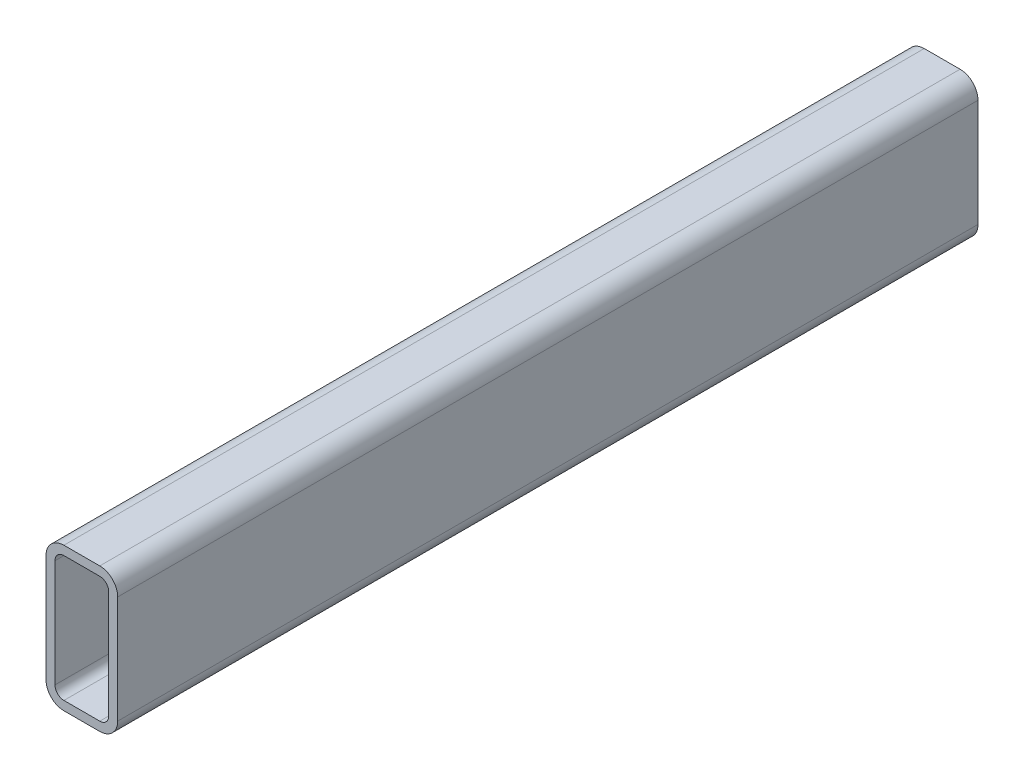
from build123d import *

# Parameters (mm, degrees)
BOSS_EXTRUDE1_DEPTH = 304.8


with BuildPart() as part:
    # Sketch1 → Boss-Extrude1 (new body)
    with BuildSketch(Plane.XY):
        with BuildLine():
            Line((6.35, 50.8), (19.05, 50.8))
            ThreePointArc((19.05, 50.8), (23.540128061, 48.940128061), (25.4, 44.45))
            Line((25.4, 44.45), (25.4, 6.35))
            ThreePointArc((25.4, 6.35), (23.540128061, 1.859871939), (19.05, 0))
            Line((19.05, 0), (6.35, 0))
            ThreePointArc((6.35, 0), (1.859871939, 1.859871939), (0, 6.35))
            Line((0, 6.35), (0, 44.45))
            ThreePointArc((0, 44.45), (1.859871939, 48.940128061), (6.35, 50.8))
        make_face()
        with BuildLine():
            Line((6.35, 47.625), (19.05, 47.625))
            ThreePointArc((19.05, 47.625), (21.29506403, 46.69506403), (22.225, 44.45))
            Line((22.225, 44.45), (22.225, 6.35))
            ThreePointArc((22.225, 6.35), (21.29506403, 4.10493597), (19.05, 3.175))
            Line((19.05, 3.175), (6.35, 3.175))
            ThreePointArc((6.35, 3.175), (4.10493597, 4.10493597), (3.175, 6.35))
            Line((3.175, 6.35), (3.175, 44.45))
            ThreePointArc((3.175, 44.45), (4.10493597, 46.69506403), (6.35, 47.625))
        make_face(mode=Mode.SUBTRACT)
    extrude(amount=BOSS_EXTRUDE1_DEPTH)


solid = part.part
